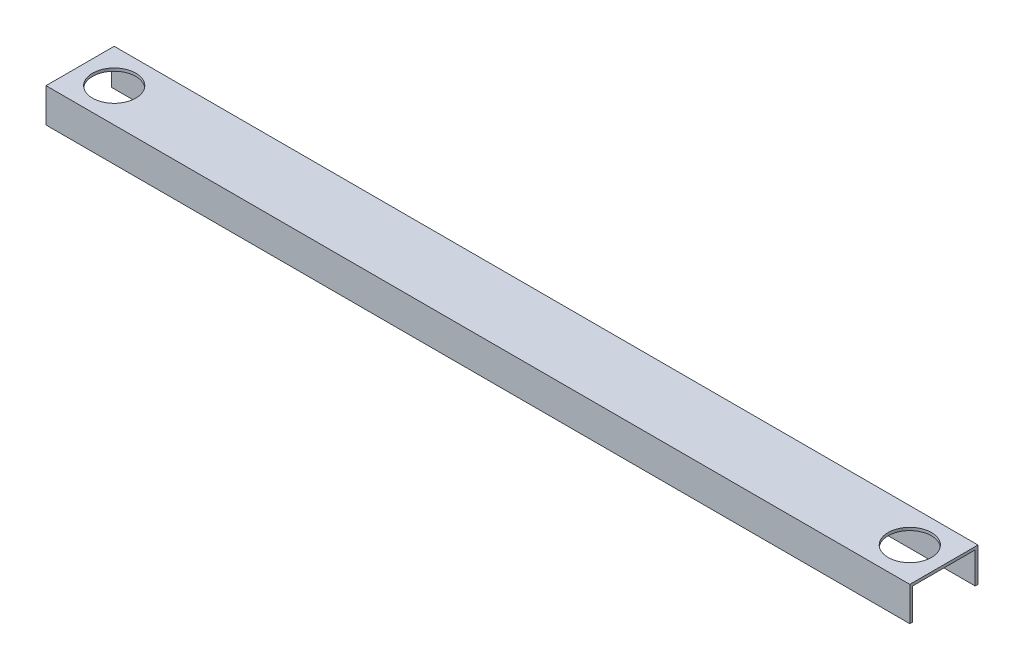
from build123d import *

# Parameters (mm, degrees)
EXTRUDE1_DEPTH = 482.6
SKETCH3_R      = 24.1935
EXTRUDE2_DEPTH = 486.598579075


with BuildPart() as part:
    # Sketch2 → Extrude1 (new, symmetric)
    with BuildSketch(Plane(origin=(0, 0, 0), x_dir=(0, 0, -1), z_dir=(1, 0, 0))):
        Polygon((-34.925, 15.875), (34.925, 15.875), (34.925, -15.875), (34.925, -19.05), (38.1, -19.05), (38.1, 19.05), (-38.1, 19.05), (-38.1, -19.05), (-34.925, -19.05), (-34.925, -15.875), align=None)
    extrude(amount=EXTRUDE1_DEPTH, both=True)

    # Sketch3 → Extrude2 (cut, through all)
    with BuildSketch(Plane(origin=(0, 19.05, 0), x_dir=(1, 0, 0), z_dir=(0, 1, 0))):
        with Locations(Location((-444.5, 0, 0), (0, 0, 270))):
            Circle(SKETCH3_R)
    extrude2 = extrude(amount=-EXTRUDE2_DEPTH, mode=Mode.SUBTRACT)

    # Mirror1: Extrude2 across plane
    add(extrude2.mirror(Plane(origin=(0, 0, 0), x_dir=(0, 0, 1), z_dir=(1, 0, 0))), mode=Mode.SUBTRACT)


solid = part.part
